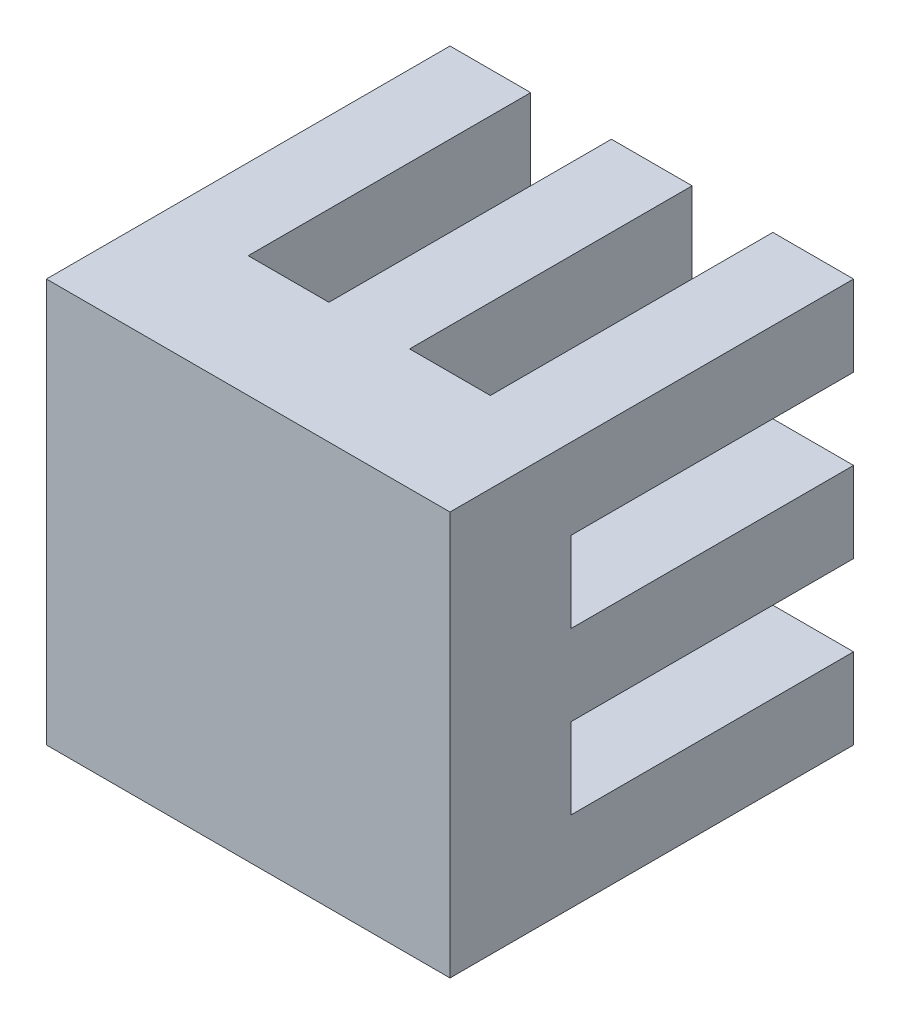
from build123d import *

# Parameters (mm, degrees)
SKETCH_1_W             = 10
SKETCH_1_H             = 10
EXTRUDE_1_DEPTH        = 10
SKETCH_2_W             = 2
SKETCH_2_H             = 7
CUT_EXTRUDE_1_DEPTH    = 10
PATTERN_LINEAR_1_COUNT = 2
PATTERN_LINEAR_1_PITCH = 4
SKETCH_3_W             = 10
SKETCH_3_H             = 2
CUT_EXTRUDE_2_DEPTH    = 7
PATTERN_LINEAR_3_COUNT = 2
PATTERN_LINEAR_3_PITCH = 4


with BuildPart() as part:
    # Sketch 1 → Extrude 1 (new body)
    with BuildSketch(Plane(origin=(0, 0, 0), x_dir=(1, 0, 0), z_dir=(0, 1, 0))):
        with Locations((5, -5)):
            Rectangle(SKETCH_1_W, SKETCH_1_H)
    extrude(amount=EXTRUDE_1_DEPTH)

    # Sketch 2 → Cut-Extrude 1 (cut)
    with BuildSketch(Plane(origin=(0, 10, 0), x_dir=(1, 0, 0), z_dir=(0, 1, 0))):
        with Locations((3, -3.5)):
            Rectangle(SKETCH_2_W, SKETCH_2_H)
    cut_extrude_1 = extrude(amount=-CUT_EXTRUDE_1_DEPTH, mode=Mode.SUBTRACT)

    # Pattern Linear 1: Cut-Extrude 1 ×2
    with Locations(*[(i * PATTERN_LINEAR_1_PITCH, 0, 0) for i in range(1, PATTERN_LINEAR_1_COUNT)]):
        add(cut_extrude_1, mode=Mode.SUBTRACT)

    # Sketch 3 → Cut-Extrude 2 (cut)
    with BuildSketch(Plane(origin=(0, 0, 0), x_dir=(-1, 0, 0), z_dir=(0, 0, -1))):
        with Locations((-5, 3)):
            Rectangle(SKETCH_3_W, SKETCH_3_H)
    cut_extrude_2 = extrude(amount=-CUT_EXTRUDE_2_DEPTH, mode=Mode.SUBTRACT)

    # Pattern Linear 3: Cut-Extrude 2 ×2
    with Locations(*[(0, i * PATTERN_LINEAR_3_PITCH, 0) for i in range(1, PATTERN_LINEAR_3_COUNT)]):
        add(cut_extrude_2, mode=Mode.SUBTRACT)


solid = part.part
